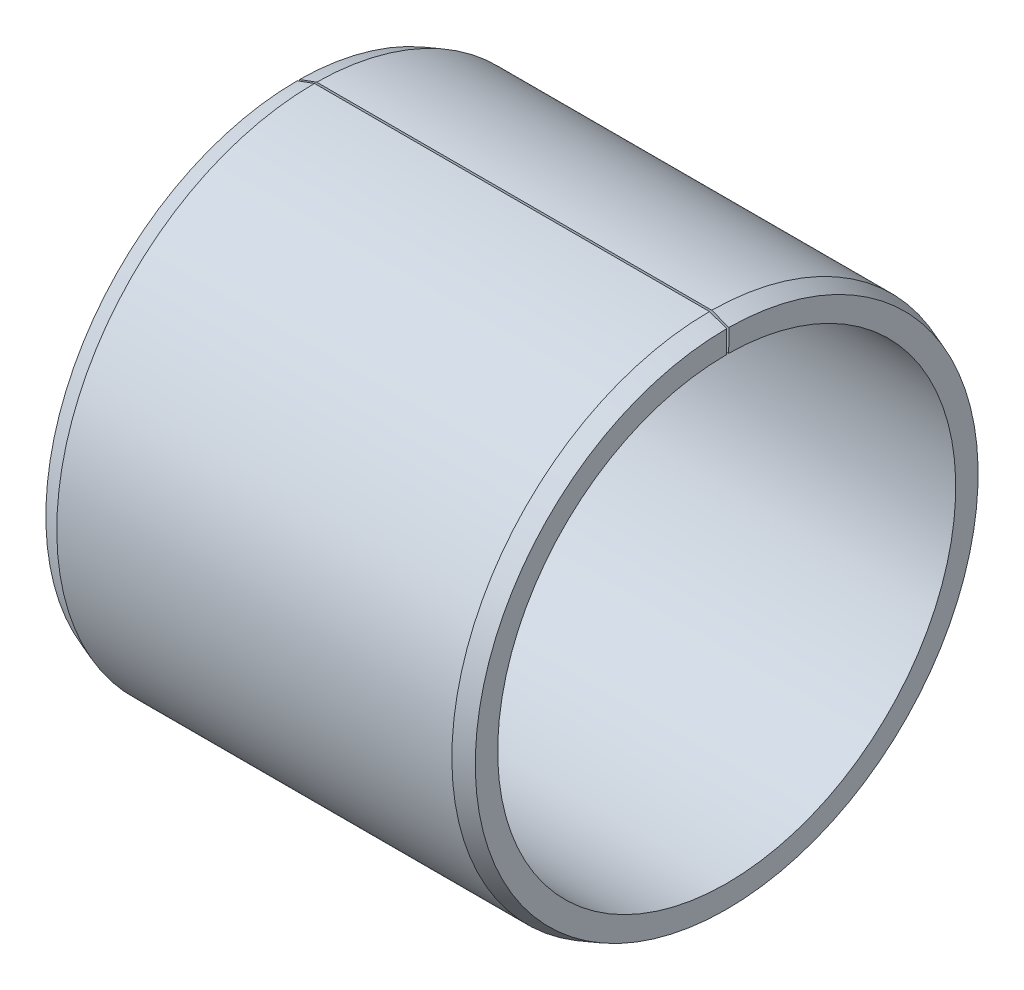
ISO-10303-21;
HEADER;
FILE_DESCRIPTION(('STEP AP214'),'2;1');
FILE_NAME('part.step','',(''),(''),'','','');
FILE_SCHEMA(('AUTOMOTIVE_DESIGN { 1 0 10303 214 1 1 1 1 }'));
ENDSEC;
DATA;
#1=APPLICATION_CONTEXT('core data for automotive mechanical design processes');
#2=APPLICATION_PROTOCOL_DEFINITION('international standard','automotive_design',2000,#1);
#3=PRODUCT_CONTEXT('',#1,'mechanical');
#4=PRODUCT('Part','Part','',(#3));
#5=PRODUCT_RELATED_PRODUCT_CATEGORY('part','',(#4));
#6=PRODUCT_DEFINITION_FORMATION('','',#4);
#7=PRODUCT_DEFINITION_CONTEXT('part definition',#1,'design');
#8=PRODUCT_DEFINITION('design','',#6,#7);
#9=PRODUCT_DEFINITION_SHAPE('','',#8);
#10=(LENGTH_UNIT() NAMED_UNIT(*) SI_UNIT(.MILLI.,.METRE.));
#11=(NAMED_UNIT(*) PLANE_ANGLE_UNIT() SI_UNIT($,.RADIAN.));
#12=(NAMED_UNIT(*) SI_UNIT($,.STERADIAN.) SOLID_ANGLE_UNIT());
#13=UNCERTAINTY_MEASURE_WITH_UNIT(LENGTH_MEASURE(1.E-05),#10,'distance_accuracy_value','');
#14=(GEOMETRIC_REPRESENTATION_CONTEXT(3) GLOBAL_UNCERTAINTY_ASSIGNED_CONTEXT((#13)) GLOBAL_UNIT_ASSIGNED_CONTEXT((#10,
#11,#12)) REPRESENTATION_CONTEXT('',''));
#15=CARTESIAN_POINT('',(0.,0.,0.));
#16=DIRECTION('',(0.,0.,1.));
#17=DIRECTION('',(1.,0.,0.));
#18=AXIS2_PLACEMENT_3D('',#15,#16,#17);
#19=CARTESIAN_POINT('',(0.,0.,0.));
#20=DIRECTION('',(-1.,0.,0.));
#21=DIRECTION('',(0.,0.,1.));
#22=AXIS2_PLACEMENT_3D('',#19,#20,#21);
#23=PLANE('',#22);
#24=CARTESIAN_POINT('',(0.,0.,0.));
#25=DIRECTION('',(-1.,0.,0.));
#26=DIRECTION('',(0.,0.,1.));
#27=AXIS2_PLACEMENT_3D('',#24,#25,#26);
#28=CIRCLE('',#27,8.);
#29=CARTESIAN_POINT('',(0.,7.99969538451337,-0.0698122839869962));
#30=VERTEX_POINT('',#29);
#31=CARTESIAN_POINT('',(0.,8.,0.));
#32=VERTEX_POINT('',#31);
#33=EDGE_CURVE('E32',#30,#32,#28,.T.);
#34=ORIENTED_EDGE('',*,*,#33,.F.);
#35=DIRECTION('',(0.,0.999961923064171,-0.00872653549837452));
#36=VECTOR('',#35,1.);
#37=CARTESIAN_POINT('',(0.,0.,0.));
#38=LINE('',#37,#36);
#39=CARTESIAN_POINT('',(0.,8.78128348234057,-0.0766330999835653));
#40=VERTEX_POINT('',#39);
#41=EDGE_CURVE('E39',#30,#40,#38,.T.);
#42=ORIENTED_EDGE('',*,*,#41,.T.);
#43=CARTESIAN_POINT('',(0.,0.,0.));
#44=DIRECTION('',(-1.,0.,0.));
#45=DIRECTION('',(0.,0.,1.));
#46=AXIS2_PLACEMENT_3D('',#43,#44,#45);
#47=CIRCLE('',#46,8.78161785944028);
#48=CARTESIAN_POINT('',(0.,8.78161785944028,0.));
#49=VERTEX_POINT('',#48);
#50=EDGE_CURVE('E114',#40,#49,#47,.T.);
#51=ORIENTED_EDGE('',*,*,#50,.T.);
#52=DIRECTION('',(0.,1.,0.));
#53=VECTOR('',#52,1.);
#54=CARTESIAN_POINT('',(0.,0.,0.));
#55=LINE('',#54,#53);
#56=EDGE_CURVE('E109',#32,#49,#55,.T.);
#57=ORIENTED_EDGE('',*,*,#56,.F.);
#58=EDGE_LOOP('',(#34,#42,#51,#57));
#59=FACE_BOUND('',#58,.T.);
#60=ADVANCED_FACE('F17',(#59),#23,.T.);
#61=CARTESIAN_POINT('',(15.,0.,0.));
#62=DIRECTION('',(-1.,0.,0.));
#63=DIRECTION('',(0.,0.,1.));
#64=AXIS2_PLACEMENT_3D('',#61,#62,#63);
#65=PLANE('',#64);
#66=DIRECTION('',(0.,0.999961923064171,-0.00872653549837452));
#67=VECTOR('',#66,1.);
#68=CARTESIAN_POINT('',(15.,0.,0.));
#69=LINE('',#68,#67);
#70=CARTESIAN_POINT('',(15.,7.99969538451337,-0.0698122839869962));
#71=VERTEX_POINT('',#70);
#72=CARTESIAN_POINT('',(15.,8.78128348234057,-0.0766330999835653));
#73=VERTEX_POINT('',#72);
#74=EDGE_CURVE('E80',#71,#73,#69,.T.);
#75=ORIENTED_EDGE('',*,*,#74,.F.);
#76=CARTESIAN_POINT('',(15.,0.,0.));
#77=DIRECTION('',(-1.,0.,0.));
#78=DIRECTION('',(0.,0.,1.));
#79=AXIS2_PLACEMENT_3D('',#76,#77,#78);
#80=CIRCLE('',#79,8.);
#81=CARTESIAN_POINT('',(15.,8.,0.));
#82=VERTEX_POINT('',#81);
#83=EDGE_CURVE('E70',#71,#82,#80,.T.);
#84=ORIENTED_EDGE('',*,*,#83,.T.);
#85=DIRECTION('',(0.,1.,0.));
#86=VECTOR('',#85,1.);
#87=CARTESIAN_POINT('',(15.,0.,0.));
#88=LINE('',#87,#86);
#89=CARTESIAN_POINT('',(15.,8.78161785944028,0.));
#90=VERTEX_POINT('',#89);
#91=EDGE_CURVE('E78',#82,#90,#88,.T.);
#92=ORIENTED_EDGE('',*,*,#91,.T.);
#93=CARTESIAN_POINT('',(15.,0.,0.));
#94=DIRECTION('',(-1.,0.,0.));
#95=DIRECTION('',(0.,0.,1.));
#96=AXIS2_PLACEMENT_3D('',#93,#94,#95);
#97=CIRCLE('',#96,8.78161785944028);
#98=EDGE_CURVE('E26',#73,#90,#97,.T.);
#99=ORIENTED_EDGE('',*,*,#98,.F.);
#100=EDGE_LOOP('',(#75,#84,#92,#99));
#101=FACE_BOUND('',#100,.T.);
#102=ADVANCED_FACE('F19',(#101),#65,.F.);
#103=CARTESIAN_POINT('',(15.,0.,0.));
#104=DIRECTION('',(-1.,0.,0.));
#105=DIRECTION('',(0.,0.,1.));
#106=AXIS2_PLACEMENT_3D('',#103,#104,#105);
#107=CONICAL_SURFACE('',#106,8.78161785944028,0.349065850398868);
#108=CARTESIAN_POINT('',(14.4,0.,0.));
#109=DIRECTION('',(-1.,0.,0.));
#110=DIRECTION('',(0.,0.,1.));
#111=AXIS2_PLACEMENT_3D('',#108,#109,#110);
#112=CIRCLE('',#111,9.);
#113=CARTESIAN_POINT('',(14.4,8.99965730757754,-0.0785388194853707));
#114=VERTEX_POINT('',#113);
#115=CARTESIAN_POINT('',(14.4,9.,0.));
#116=VERTEX_POINT('',#115);
#117=EDGE_CURVE('E131',#114,#116,#112,.T.);
#118=ORIENTED_EDGE('',*,*,#117,.F.);
#119=DIRECTION('',(-0.939692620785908,0.342007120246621,-0.0029846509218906));
#120=VECTOR('',#119,1.);
#121=CARTESIAN_POINT('',(15.,8.78128348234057,-0.0766330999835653));
#122=LINE('',#121,#120);
#123=EDGE_CURVE('E115',#73,#114,#122,.T.);
#124=ORIENTED_EDGE('',*,*,#123,.F.);
#125=ORIENTED_EDGE('',*,*,#98,.T.);
#126=DIRECTION('',(-0.939692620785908,0.34202014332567,0.));
#127=VECTOR('',#126,1.);
#128=CARTESIAN_POINT('',(15.,8.78161785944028,0.));
#129=LINE('',#128,#127);
#130=EDGE_CURVE('E87',#90,#116,#129,.T.);
#131=ORIENTED_EDGE('',*,*,#130,.T.);
#132=EDGE_LOOP('',(#118,#124,#125,#131));
#133=FACE_BOUND('',#132,.T.);
#134=ADVANCED_FACE('F137',(#133),#107,.T.);
#135=CARTESIAN_POINT('',(0.,0.,0.));
#136=DIRECTION('',(-1.,0.,0.));
#137=DIRECTION('',(0.,0.,1.));
#138=AXIS2_PLACEMENT_3D('',#135,#136,#137);
#139=CYLINDRICAL_SURFACE('',#138,9.);
#140=CARTESIAN_POINT('',(0.6,0.,0.));
#141=DIRECTION('',(-1.,0.,0.));
#142=DIRECTION('',(0.,0.,1.));
#143=AXIS2_PLACEMENT_3D('',#140,#141,#142);
#144=CIRCLE('',#143,9.);
#145=CARTESIAN_POINT('',(0.6,8.99965730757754,-0.0785388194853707));
#146=VERTEX_POINT('',#145);
#147=CARTESIAN_POINT('',(0.6,9.,0.));
#148=VERTEX_POINT('',#147);
#149=EDGE_CURVE('E128',#146,#148,#144,.T.);
#150=ORIENTED_EDGE('',*,*,#149,.F.);
#151=DIRECTION('',(1.,0.,0.));
#152=VECTOR('',#151,1.);
#153=CARTESIAN_POINT('',(0.6,8.99965730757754,-0.0785388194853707));
#154=LINE('',#153,#152);
#155=EDGE_CURVE('E119',#146,#114,#154,.T.);
#156=ORIENTED_EDGE('',*,*,#155,.T.);
#157=ORIENTED_EDGE('',*,*,#117,.T.);
#158=DIRECTION('',(1.,0.,0.));
#159=VECTOR('',#158,1.);
#160=CARTESIAN_POINT('',(0.6,9.,0.));
#161=LINE('',#160,#159);
#162=EDGE_CURVE('E97',#148,#116,#161,.T.);
#163=ORIENTED_EDGE('',*,*,#162,.F.);
#164=EDGE_LOOP('',(#150,#156,#157,#163));
#165=FACE_BOUND('',#164,.T.);
#166=ADVANCED_FACE('F176',(#165),#139,.T.);
#167=CARTESIAN_POINT('',(0.6,0.,0.));
#168=DIRECTION('',(1.,0.,0.));
#169=DIRECTION('',(0.,0.,-1.));
#170=AXIS2_PLACEMENT_3D('',#167,#168,#169);
#171=CONICAL_SURFACE('',#170,9.,0.349065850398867);
#172=DIRECTION('',(-0.939692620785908,-0.34200712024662,0.0029846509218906));
#173=VECTOR('',#172,1.);
#174=CARTESIAN_POINT('',(0.6,8.99965730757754,-0.0785388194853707));
#175=LINE('',#174,#173);
#176=EDGE_CURVE('E94',#146,#40,#175,.T.);
#177=ORIENTED_EDGE('',*,*,#176,.F.);
#178=ORIENTED_EDGE('',*,*,#149,.T.);
#179=DIRECTION('',(-0.939692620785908,-0.342020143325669,0.));
#180=VECTOR('',#179,1.);
#181=CARTESIAN_POINT('',(0.6,9.,0.));
#182=LINE('',#181,#180);
#183=EDGE_CURVE('E105',#148,#49,#182,.T.);
#184=ORIENTED_EDGE('',*,*,#183,.T.);
#185=ORIENTED_EDGE('',*,*,#50,.F.);
#186=EDGE_LOOP('',(#177,#178,#184,#185));
#187=FACE_BOUND('',#186,.T.);
#188=ADVANCED_FACE('F184',(#187),#171,.T.);
#189=CARTESIAN_POINT('',(0.,8.99965730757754,-0.0785388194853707));
#190=DIRECTION('',(0.,-0.00872653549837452,-0.999961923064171));
#191=DIRECTION('',(-1.,0.,0.));
#192=AXIS2_PLACEMENT_3D('',#189,#190,#191);
#193=PLANE('',#192);
#194=ORIENTED_EDGE('',*,*,#41,.F.);
#195=DIRECTION('',(1.,0.,0.));
#196=VECTOR('',#195,1.);
#197=CARTESIAN_POINT('',(-1.,7.99969538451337,-0.0698122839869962));
#198=LINE('',#197,#196);
#199=EDGE_CURVE('E100',#30,#71,#198,.T.);
#200=ORIENTED_EDGE('',*,*,#199,.T.);
#201=ORIENTED_EDGE('',*,*,#74,.T.);
#202=ORIENTED_EDGE('',*,*,#123,.T.);
#203=ORIENTED_EDGE('',*,*,#155,.F.);
#204=ORIENTED_EDGE('',*,*,#176,.T.);
#205=EDGE_LOOP('',(#194,#200,#201,#202,#203,#204));
#206=FACE_BOUND('',#205,.T.);
#207=ADVANCED_FACE('F140',(#206),#193,.F.);
#208=CARTESIAN_POINT('',(0.,9.,0.));
#209=DIRECTION('',(0.,0.,-1.));
#210=DIRECTION('',(-1.,0.,0.));
#211=AXIS2_PLACEMENT_3D('',#208,#209,#210);
#212=PLANE('',#211);
#213=DIRECTION('',(1.,0.,0.));
#214=VECTOR('',#213,1.);
#215=CARTESIAN_POINT('',(-1.,8.,0.));
#216=LINE('',#215,#214);
#217=EDGE_CURVE('E11',#32,#82,#216,.T.);
#218=ORIENTED_EDGE('',*,*,#217,.F.);
#219=ORIENTED_EDGE('',*,*,#56,.T.);
#220=ORIENTED_EDGE('',*,*,#183,.F.);
#221=ORIENTED_EDGE('',*,*,#162,.T.);
#222=ORIENTED_EDGE('',*,*,#130,.F.);
#223=ORIENTED_EDGE('',*,*,#91,.F.);
#224=EDGE_LOOP('',(#218,#219,#220,#221,#222,#223));
#225=FACE_BOUND('',#224,.T.);
#226=ADVANCED_FACE('F84',(#225),#212,.T.);
#227=CARTESIAN_POINT('',(-1.,0.,0.));
#228=DIRECTION('',(1.,0.,0.));
#229=DIRECTION('',(0.,-1.,0.));
#230=AXIS2_PLACEMENT_3D('',#227,#228,#229);
#231=CYLINDRICAL_SURFACE('',#230,8.);
#232=ORIENTED_EDGE('',*,*,#33,.T.);
#233=ORIENTED_EDGE('',*,*,#217,.T.);
#234=ORIENTED_EDGE('',*,*,#83,.F.);
#235=ORIENTED_EDGE('',*,*,#199,.F.);
#236=EDGE_LOOP('',(#232,#233,#234,#235));
#237=FACE_BOUND('',#236,.T.);
#238=ADVANCED_FACE('F69',(#237),#231,.F.);
#239=CLOSED_SHELL('',(#60,#102,#134,#166,#188,#207,#226,#238));
#240=MANIFOLD_SOLID_BREP('B1',#239);
#241=ADVANCED_BREP_SHAPE_REPRESENTATION('',(#18,#240),#14);
#242=SHAPE_DEFINITION_REPRESENTATION(#9,#241);
ENDSEC;
END-ISO-10303-21;
